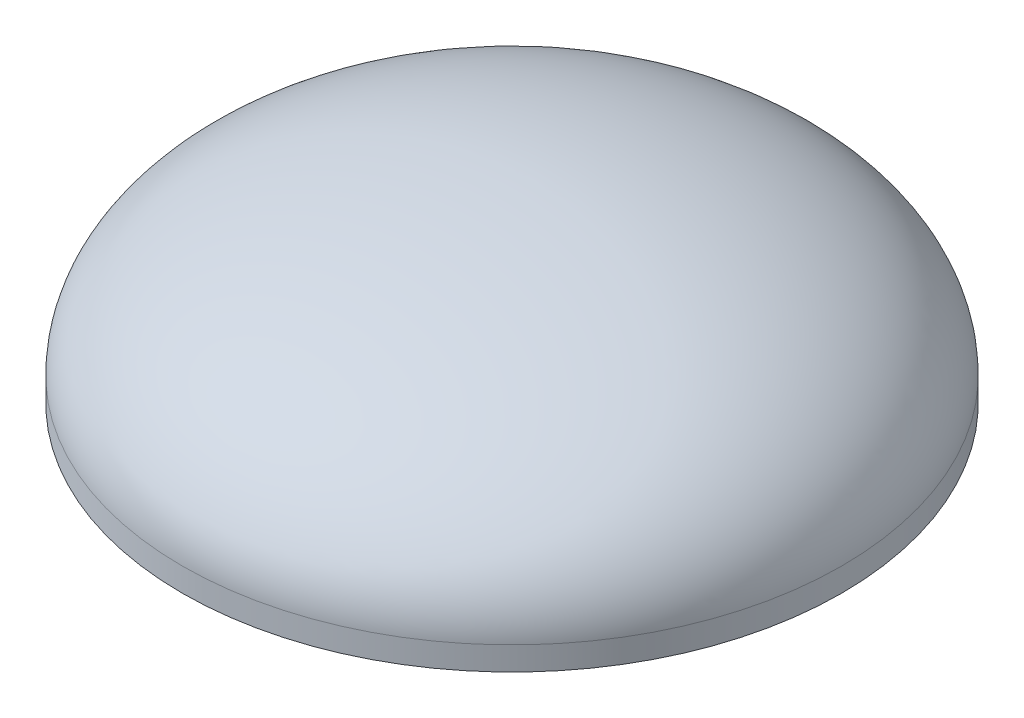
ISO-10303-21;
HEADER;
FILE_DESCRIPTION(('STEP AP214'),'2;1');
FILE_NAME('part.step','',(''),(''),'','','');
FILE_SCHEMA(('AUTOMOTIVE_DESIGN { 1 0 10303 214 1 1 1 1 }'));
ENDSEC;
DATA;
#1=APPLICATION_CONTEXT('core data for automotive mechanical design processes');
#2=APPLICATION_PROTOCOL_DEFINITION('international standard','automotive_design',2000,#1);
#3=PRODUCT_CONTEXT('',#1,'mechanical');
#4=PRODUCT('Part','Part','',(#3));
#5=PRODUCT_RELATED_PRODUCT_CATEGORY('part','',(#4));
#6=PRODUCT_DEFINITION_FORMATION('','',#4);
#7=PRODUCT_DEFINITION_CONTEXT('part definition',#1,'design');
#8=PRODUCT_DEFINITION('design','',#6,#7);
#9=PRODUCT_DEFINITION_SHAPE('','',#8);
#10=(LENGTH_UNIT() NAMED_UNIT(*) SI_UNIT(.MILLI.,.METRE.));
#11=(NAMED_UNIT(*) PLANE_ANGLE_UNIT() SI_UNIT($,.RADIAN.));
#12=(NAMED_UNIT(*) SI_UNIT($,.STERADIAN.) SOLID_ANGLE_UNIT());
#13=UNCERTAINTY_MEASURE_WITH_UNIT(LENGTH_MEASURE(1.E-05),#10,'distance_accuracy_value','');
#14=(GEOMETRIC_REPRESENTATION_CONTEXT(3) GLOBAL_UNCERTAINTY_ASSIGNED_CONTEXT((#13)) GLOBAL_UNIT_ASSIGNED_CONTEXT((#10,
#11,#12)) REPRESENTATION_CONTEXT('',''));
#15=CARTESIAN_POINT('',(0.,0.,0.));
#16=DIRECTION('',(0.,0.,1.));
#17=DIRECTION('',(1.,0.,0.));
#18=AXIS2_PLACEMENT_3D('',#15,#16,#17);
#19=CARTESIAN_POINT('',(0.,0.,0.));
#20=DIRECTION('',(0.,0.,1.));
#21=DIRECTION('',(-1.,0.,0.));
#22=AXIS2_PLACEMENT_3D('',#19,#20,#21);
#23=ELLIPSE('',#22,711.2,355.6);
#24=TRIMMED_CURVE('',#23,(PARAMETER_VALUE(1.5707963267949)),(PARAMETER_VALUE(4.71238898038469)),
.T.,.PARAMETER.);
#25=CARTESIAN_POINT('',(0.,441.323897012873,0.));
#26=DIRECTION('',(0.,1.,0.));
#27=AXIS1_PLACEMENT('',#25,#26);
#28=SURFACE_OF_REVOLUTION('',#24,#27);
#29=CARTESIAN_POINT('',(0.,355.6,0.));
#30=VERTEX_POINT('',#29);
#31=VERTEX_LOOP('',#30);
#32=FACE_BOUND('',#31,.T.);
#33=CARTESIAN_POINT('',(0.,0.,0.));
#34=DIRECTION('',(0.,1.,0.));
#35=DIRECTION('',(-1.,0.,0.));
#36=AXIS2_PLACEMENT_3D('',#33,#34,#35);
#37=CIRCLE('',#36,711.2);
#38=CARTESIAN_POINT('',(-711.2,0.,0.));
#39=VERTEX_POINT('',#38);
#40=EDGE_CURVE('E46',#39,#39,#37,.T.);
#41=ORIENTED_EDGE('',*,*,#40,.T.);
#42=EDGE_LOOP('',(#41));
#43=FACE_BOUND('',#42,.T.);
#44=ADVANCED_FACE('F38',(#32,#43),#28,.T.);
#45=CARTESIAN_POINT('',(711.2,-50.8,0.));
#46=DIRECTION('',(0.,1.,0.));
#47=DIRECTION('',(-1.,0.,0.));
#48=AXIS2_PLACEMENT_3D('',#45,#46,#47);
#49=PLANE('',#48);
#50=CARTESIAN_POINT('',(0.,-50.8000000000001,0.));
#51=DIRECTION('',(0.,1.,0.));
#52=DIRECTION('',(-1.,0.,0.));
#53=AXIS2_PLACEMENT_3D('',#50,#51,#52);
#54=CIRCLE('',#53,698.5);
#55=CARTESIAN_POINT('',(-698.5,-50.8000000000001,0.));
#56=VERTEX_POINT('',#55);
#57=EDGE_CURVE('E62',#56,#56,#54,.T.);
#58=ORIENTED_EDGE('',*,*,#57,.T.);
#59=EDGE_LOOP('',(#58));
#60=FACE_BOUND('',#59,.T.);
#61=CARTESIAN_POINT('',(0.,-50.8,0.));
#62=DIRECTION('',(0.,1.,0.));
#63=DIRECTION('',(-1.,0.,0.));
#64=AXIS2_PLACEMENT_3D('',#61,#62,#63);
#65=CIRCLE('',#64,711.2);
#66=CARTESIAN_POINT('',(-711.2,-50.8,0.));
#67=VERTEX_POINT('',#66);
#68=EDGE_CURVE('E11',#67,#67,#65,.T.);
#69=ORIENTED_EDGE('',*,*,#68,.F.);
#70=EDGE_LOOP('',(#69));
#71=FACE_BOUND('',#70,.T.);
#72=ADVANCED_FACE('F75',(#60,#71),#49,.F.);
#73=CARTESIAN_POINT('',(0.,441.323897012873,0.));
#74=DIRECTION('',(0.,1.,0.));
#75=DIRECTION('',(-1.,0.,0.));
#76=AXIS2_PLACEMENT_3D('',#73,#74,#75);
#77=CYLINDRICAL_SURFACE('',#76,711.2);
#78=ORIENTED_EDGE('',*,*,#40,.F.);
#79=EDGE_LOOP('',(#78));
#80=FACE_BOUND('',#79,.T.);
#81=ORIENTED_EDGE('',*,*,#68,.T.);
#82=EDGE_LOOP('',(#81));
#83=FACE_BOUND('',#82,.T.);
#84=ADVANCED_FACE('F56',(#80,#83),#77,.T.);
#85=CARTESIAN_POINT('',(0.,0.,0.));
#86=DIRECTION('',(0.,0.,1.));
#87=DIRECTION('',(-1.,0.,0.));
#88=AXIS2_PLACEMENT_3D('',#85,#86,#87);
#89=ELLIPSE('',#88,711.2,355.6);
#90=TRIMMED_CURVE('',#89,(PARAMETER_VALUE(1.5707963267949)),(PARAMETER_VALUE(4.71238898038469)),
.T.,.PARAMETER.);
#91=CARTESIAN_POINT('',(0.,441.323897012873,0.));
#92=DIRECTION('',(0.,1.,0.));
#93=AXIS1_PLACEMENT('',#91,#92);
#94=SURFACE_OF_REVOLUTION('',#90,#93);
#95=OFFSET_SURFACE('',#94,-12.7,.F.);
#96=CARTESIAN_POINT('',(1.29478844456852E-13,342.9,0.));
#97=VERTEX_POINT('',#96);
#98=VERTEX_LOOP('',#97);
#99=FACE_BOUND('',#98,.T.);
#100=CARTESIAN_POINT('',(0.,0.,0.));
#101=DIRECTION('',(0.,1.,0.));
#102=DIRECTION('',(1.,0.,0.));
#103=AXIS2_PLACEMENT_3D('',#100,#101,#102);
#104=CIRCLE('',#103,698.5);
#105=CARTESIAN_POINT('',(698.5,0.,0.));
#106=VERTEX_POINT('',#105);
#107=EDGE_CURVE('E60',#106,#106,#104,.T.);
#108=ORIENTED_EDGE('',*,*,#107,.F.);
#109=EDGE_LOOP('',(#108));
#110=FACE_BOUND('',#109,.T.);
#111=ADVANCED_FACE('F52',(#99,#110),#95,.F.);
#112=CARTESIAN_POINT('',(0.,441.323897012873,0.));
#113=DIRECTION('',(0.,1.,0.));
#114=DIRECTION('',(-1.,0.,0.));
#115=AXIS2_PLACEMENT_3D('',#112,#113,#114);
#116=CYLINDRICAL_SURFACE('',#115,698.5);
#117=ORIENTED_EDGE('',*,*,#107,.T.);
#118=EDGE_LOOP('',(#117));
#119=FACE_BOUND('',#118,.T.);
#120=ORIENTED_EDGE('',*,*,#57,.F.);
#121=EDGE_LOOP('',(#120));
#122=FACE_BOUND('',#121,.T.);
#123=ADVANCED_FACE('F55',(#119,#122),#116,.F.);
#124=CLOSED_SHELL('',(#44,#72,#84,#111,#123));
#125=MANIFOLD_SOLID_BREP('B2',#124);
#126=ADVANCED_BREP_SHAPE_REPRESENTATION('',(#18,#125),#14);
#127=SHAPE_DEFINITION_REPRESENTATION(#9,#126);
ENDSEC;
END-ISO-10303-21;
